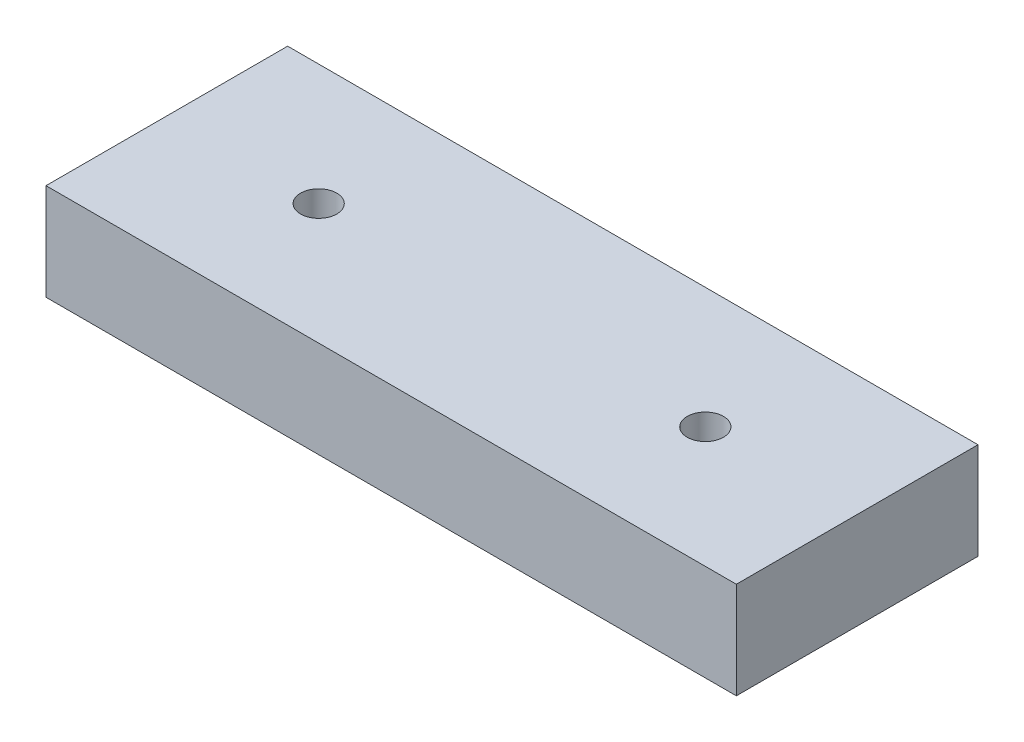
ISO-10303-21;
HEADER;
FILE_DESCRIPTION(('STEP AP214'),'2;1');
FILE_NAME('part.step','',(''),(''),'','','');
FILE_SCHEMA(('AUTOMOTIVE_DESIGN { 1 0 10303 214 1 1 1 1 }'));
ENDSEC;
DATA;
#1=APPLICATION_CONTEXT('core data for automotive mechanical design processes');
#2=APPLICATION_PROTOCOL_DEFINITION('international standard','automotive_design',2000,#1);
#3=PRODUCT_CONTEXT('',#1,'mechanical');
#4=PRODUCT('Part','Part','',(#3));
#5=PRODUCT_RELATED_PRODUCT_CATEGORY('part','',(#4));
#6=PRODUCT_DEFINITION_FORMATION('','',#4);
#7=PRODUCT_DEFINITION_CONTEXT('part definition',#1,'design');
#8=PRODUCT_DEFINITION('design','',#6,#7);
#9=PRODUCT_DEFINITION_SHAPE('','',#8);
#10=(LENGTH_UNIT() NAMED_UNIT(*) SI_UNIT(.MILLI.,.METRE.));
#11=(NAMED_UNIT(*) PLANE_ANGLE_UNIT() SI_UNIT($,.RADIAN.));
#12=(NAMED_UNIT(*) SI_UNIT($,.STERADIAN.) SOLID_ANGLE_UNIT());
#13=UNCERTAINTY_MEASURE_WITH_UNIT(LENGTH_MEASURE(1.E-05),#10,'distance_accuracy_value','');
#14=(GEOMETRIC_REPRESENTATION_CONTEXT(3) GLOBAL_UNCERTAINTY_ASSIGNED_CONTEXT((#13)) GLOBAL_UNIT_ASSIGNED_CONTEXT((#10,
#11,#12)) REPRESENTATION_CONTEXT('',''));
#15=CARTESIAN_POINT('',(0.,0.,0.));
#16=DIRECTION('',(0.,0.,1.));
#17=DIRECTION('',(1.,0.,0.));
#18=AXIS2_PLACEMENT_3D('',#15,#16,#17);
#19=CARTESIAN_POINT('',(90.7034,25.4,31.75));
#20=DIRECTION('',(0.,-1.,0.));
#21=DIRECTION('',(0.,0.,-1.));
#22=AXIS2_PLACEMENT_3D('',#19,#20,#21);
#23=PLANE('',#22);
#24=CARTESIAN_POINT('',(50.8,25.4,0.));
#25=DIRECTION('',(0.,1.,0.));
#26=DIRECTION('',(0.,0.,1.));
#27=AXIS2_PLACEMENT_3D('',#24,#25,#26);
#28=CIRCLE('',#27,4.7625);
#29=CARTESIAN_POINT('',(50.8,25.4,4.7625));
#30=VERTEX_POINT('',#29);
#31=EDGE_CURVE('E85',#30,#30,#28,.T.);
#32=ORIENTED_EDGE('',*,*,#31,.F.);
#33=EDGE_LOOP('',(#32));
#34=FACE_BOUND('',#33,.T.);
#35=DIRECTION('',(0.,0.,-1.));
#36=VECTOR('',#35,1.);
#37=CARTESIAN_POINT('',(90.7034,25.4,-31.7500000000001));
#38=LINE('',#37,#36);
#39=CARTESIAN_POINT('',(90.7034,25.4,31.75));
#40=VERTEX_POINT('',#39);
#41=CARTESIAN_POINT('',(90.7034,25.4,-31.7500000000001));
#42=VERTEX_POINT('',#41);
#43=EDGE_CURVE('E95',#40,#42,#38,.T.);
#44=ORIENTED_EDGE('',*,*,#43,.T.);
#45=DIRECTION('',(-1.,0.,0.));
#46=VECTOR('',#45,1.);
#47=CARTESIAN_POINT('',(90.7034,25.4,-31.7500000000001));
#48=LINE('',#47,#46);
#49=CARTESIAN_POINT('',(-90.7034,25.4,-31.75));
#50=VERTEX_POINT('',#49);
#51=EDGE_CURVE('E80',#42,#50,#48,.T.);
#52=ORIENTED_EDGE('',*,*,#51,.T.);
#53=DIRECTION('',(0.,0.,1.));
#54=VECTOR('',#53,1.);
#55=CARTESIAN_POINT('',(-90.7034,25.4,-31.75));
#56=LINE('',#55,#54);
#57=CARTESIAN_POINT('',(-90.7033999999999,25.4,31.75));
#58=VERTEX_POINT('',#57);
#59=EDGE_CURVE('E46',#50,#58,#56,.T.);
#60=ORIENTED_EDGE('',*,*,#59,.T.);
#61=DIRECTION('',(1.,0.,0.));
#62=VECTOR('',#61,1.);
#63=CARTESIAN_POINT('',(90.7034,25.4,31.75));
#64=LINE('',#63,#62);
#65=EDGE_CURVE('E41',#58,#40,#64,.T.);
#66=ORIENTED_EDGE('',*,*,#65,.T.);
#67=EDGE_LOOP('',(#44,#52,#60,#66));
#68=FACE_BOUND('',#67,.T.);
#69=CARTESIAN_POINT('',(-50.8,25.4,0.));
#70=DIRECTION('',(0.,1.,0.));
#71=DIRECTION('',(0.,0.,1.));
#72=AXIS2_PLACEMENT_3D('',#69,#70,#71);
#73=CIRCLE('',#72,4.7625);
#74=CARTESIAN_POINT('',(-50.8,25.4,4.76250000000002));
#75=VERTEX_POINT('',#74);
#76=EDGE_CURVE('E113',#75,#75,#73,.T.);
#77=ORIENTED_EDGE('',*,*,#76,.F.);
#78=EDGE_LOOP('',(#77));
#79=FACE_BOUND('',#78,.T.);
#80=ADVANCED_FACE('F26',(#34,#68,#79),#23,.F.);
#81=CARTESIAN_POINT('',(90.7034,0.,31.75));
#82=DIRECTION('',(0.,-1.,0.));
#83=DIRECTION('',(0.,0.,-1.));
#84=AXIS2_PLACEMENT_3D('',#81,#82,#83);
#85=PLANE('',#84);
#86=CARTESIAN_POINT('',(50.8,0.,0.));
#87=DIRECTION('',(0.,1.,0.));
#88=DIRECTION('',(0.,0.,1.));
#89=AXIS2_PLACEMENT_3D('',#86,#87,#88);
#90=CIRCLE('',#89,4.7625);
#91=CARTESIAN_POINT('',(50.8,0.,4.7625));
#92=VERTEX_POINT('',#91);
#93=EDGE_CURVE('E88',#92,#92,#90,.T.);
#94=ORIENTED_EDGE('',*,*,#93,.T.);
#95=EDGE_LOOP('',(#94));
#96=FACE_BOUND('',#95,.T.);
#97=DIRECTION('',(0.,0.,-1.));
#98=VECTOR('',#97,1.);
#99=CARTESIAN_POINT('',(90.7034,0.,-31.7500000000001));
#100=LINE('',#99,#98);
#101=CARTESIAN_POINT('',(90.7034,0.,31.75));
#102=VERTEX_POINT('',#101);
#103=CARTESIAN_POINT('',(90.7034,0.,-31.7500000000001));
#104=VERTEX_POINT('',#103);
#105=EDGE_CURVE('E72',#102,#104,#100,.T.);
#106=ORIENTED_EDGE('',*,*,#105,.F.);
#107=DIRECTION('',(1.,0.,0.));
#108=VECTOR('',#107,1.);
#109=CARTESIAN_POINT('',(90.7034,0.,31.75));
#110=LINE('',#109,#108);
#111=CARTESIAN_POINT('',(-90.7033999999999,0.,31.75));
#112=VERTEX_POINT('',#111);
#113=EDGE_CURVE('E93',#112,#102,#110,.T.);
#114=ORIENTED_EDGE('',*,*,#113,.F.);
#115=DIRECTION('',(0.,0.,1.));
#116=VECTOR('',#115,1.);
#117=CARTESIAN_POINT('',(-90.7034,0.,-31.75));
#118=LINE('',#117,#116);
#119=CARTESIAN_POINT('',(-90.7034,0.,-31.75));
#120=VERTEX_POINT('',#119);
#121=EDGE_CURVE('E73',#120,#112,#118,.T.);
#122=ORIENTED_EDGE('',*,*,#121,.F.);
#123=DIRECTION('',(-1.,0.,0.));
#124=VECTOR('',#123,1.);
#125=CARTESIAN_POINT('',(90.7034,0.,-31.7500000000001));
#126=LINE('',#125,#124);
#127=EDGE_CURVE('E67',#104,#120,#126,.T.);
#128=ORIENTED_EDGE('',*,*,#127,.F.);
#129=EDGE_LOOP('',(#106,#114,#122,#128));
#130=FACE_BOUND('',#129,.T.);
#131=CARTESIAN_POINT('',(-50.8,0.,0.));
#132=DIRECTION('',(0.,1.,0.));
#133=DIRECTION('',(0.,0.,1.));
#134=AXIS2_PLACEMENT_3D('',#131,#132,#133);
#135=CIRCLE('',#134,4.7625);
#136=CARTESIAN_POINT('',(-50.8,0.,4.76250000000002));
#137=VERTEX_POINT('',#136);
#138=EDGE_CURVE('E115',#137,#137,#135,.T.);
#139=ORIENTED_EDGE('',*,*,#138,.T.);
#140=EDGE_LOOP('',(#139));
#141=FACE_BOUND('',#140,.T.);
#142=ADVANCED_FACE('F68',(#96,#130,#141),#85,.T.);
#143=CARTESIAN_POINT('',(90.7034,25.4,-31.7500000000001));
#144=DIRECTION('',(-1.,0.,0.));
#145=DIRECTION('',(0.,0.,1.));
#146=AXIS2_PLACEMENT_3D('',#143,#144,#145);
#147=PLANE('',#146);
#148=ORIENTED_EDGE('',*,*,#105,.T.);
#149=DIRECTION('',(0.,-1.,0.));
#150=VECTOR('',#149,1.);
#151=CARTESIAN_POINT('',(90.7034,25.4,-31.7500000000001));
#152=LINE('',#151,#150);
#153=EDGE_CURVE('E11',#42,#104,#152,.T.);
#154=ORIENTED_EDGE('',*,*,#153,.F.);
#155=ORIENTED_EDGE('',*,*,#43,.F.);
#156=DIRECTION('',(0.,-1.,0.));
#157=VECTOR('',#156,1.);
#158=CARTESIAN_POINT('',(90.7034,25.4,31.75));
#159=LINE('',#158,#157);
#160=EDGE_CURVE('E84',#40,#102,#159,.T.);
#161=ORIENTED_EDGE('',*,*,#160,.T.);
#162=EDGE_LOOP('',(#148,#154,#155,#161));
#163=FACE_BOUND('',#162,.T.);
#164=ADVANCED_FACE('F28',(#163),#147,.F.);
#165=CARTESIAN_POINT('',(90.7034,25.4,-31.7500000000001));
#166=DIRECTION('',(0.,0.,1.));
#167=DIRECTION('',(1.,0.,0.));
#168=AXIS2_PLACEMENT_3D('',#165,#166,#167);
#169=PLANE('',#168);
#170=ORIENTED_EDGE('',*,*,#127,.T.);
#171=DIRECTION('',(0.,-1.,0.));
#172=VECTOR('',#171,1.);
#173=CARTESIAN_POINT('',(-90.7034,25.4,-31.75));
#174=LINE('',#173,#172);
#175=EDGE_CURVE('E34',#50,#120,#174,.T.);
#176=ORIENTED_EDGE('',*,*,#175,.F.);
#177=ORIENTED_EDGE('',*,*,#51,.F.);
#178=ORIENTED_EDGE('',*,*,#153,.T.);
#179=EDGE_LOOP('',(#170,#176,#177,#178));
#180=FACE_BOUND('',#179,.T.);
#181=ADVANCED_FACE('F79',(#180),#169,.F.);
#182=CARTESIAN_POINT('',(-90.7034,25.4,-31.75));
#183=DIRECTION('',(1.,0.,0.));
#184=DIRECTION('',(0.,0.,-1.));
#185=AXIS2_PLACEMENT_3D('',#182,#183,#184);
#186=PLANE('',#185);
#187=ORIENTED_EDGE('',*,*,#121,.T.);
#188=DIRECTION('',(0.,-1.,0.));
#189=VECTOR('',#188,1.);
#190=CARTESIAN_POINT('',(-90.7033999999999,25.4,31.75));
#191=LINE('',#190,#189);
#192=EDGE_CURVE('E101',#58,#112,#191,.T.);
#193=ORIENTED_EDGE('',*,*,#192,.F.);
#194=ORIENTED_EDGE('',*,*,#59,.F.);
#195=ORIENTED_EDGE('',*,*,#175,.T.);
#196=EDGE_LOOP('',(#187,#193,#194,#195));
#197=FACE_BOUND('',#196,.T.);
#198=ADVANCED_FACE('F104',(#197),#186,.F.);
#199=CARTESIAN_POINT('',(90.7034,25.4,31.75));
#200=DIRECTION('',(0.,0.,-1.));
#201=DIRECTION('',(-1.,0.,0.));
#202=AXIS2_PLACEMENT_3D('',#199,#200,#201);
#203=PLANE('',#202);
#204=ORIENTED_EDGE('',*,*,#113,.T.);
#205=ORIENTED_EDGE('',*,*,#160,.F.);
#206=ORIENTED_EDGE('',*,*,#65,.F.);
#207=ORIENTED_EDGE('',*,*,#192,.T.);
#208=EDGE_LOOP('',(#204,#205,#206,#207));
#209=FACE_BOUND('',#208,.T.);
#210=ADVANCED_FACE('F106',(#209),#203,.F.);
#211=CARTESIAN_POINT('',(50.8,25.4,0.));
#212=DIRECTION('',(0.,-1.,0.));
#213=DIRECTION('',(0.,0.,-1.));
#214=AXIS2_PLACEMENT_3D('',#211,#212,#213);
#215=CYLINDRICAL_SURFACE('',#214,4.7625);
#216=ORIENTED_EDGE('',*,*,#31,.T.);
#217=EDGE_LOOP('',(#216));
#218=FACE_BOUND('',#217,.T.);
#219=ORIENTED_EDGE('',*,*,#93,.F.);
#220=EDGE_LOOP('',(#219));
#221=FACE_BOUND('',#220,.T.);
#222=ADVANCED_FACE('F124',(#218,#221),#215,.F.);
#223=CARTESIAN_POINT('',(-50.8,25.4,0.));
#224=DIRECTION('',(0.,-1.,0.));
#225=DIRECTION('',(0.,0.,-1.));
#226=AXIS2_PLACEMENT_3D('',#223,#224,#225);
#227=CYLINDRICAL_SURFACE('',#226,4.7625);
#228=ORIENTED_EDGE('',*,*,#76,.T.);
#229=EDGE_LOOP('',(#228));
#230=FACE_BOUND('',#229,.T.);
#231=ORIENTED_EDGE('',*,*,#138,.F.);
#232=EDGE_LOOP('',(#231));
#233=FACE_BOUND('',#232,.T.);
#234=ADVANCED_FACE('F122',(#230,#233),#227,.F.);
#235=CLOSED_SHELL('',(#80,#142,#164,#181,#198,#210,#222,#234));
#236=MANIFOLD_SOLID_BREP('B2',#235);
#237=ADVANCED_BREP_SHAPE_REPRESENTATION('',(#18,#236),#14);
#238=SHAPE_DEFINITION_REPRESENTATION(#9,#237);
ENDSEC;
END-ISO-10303-21;
